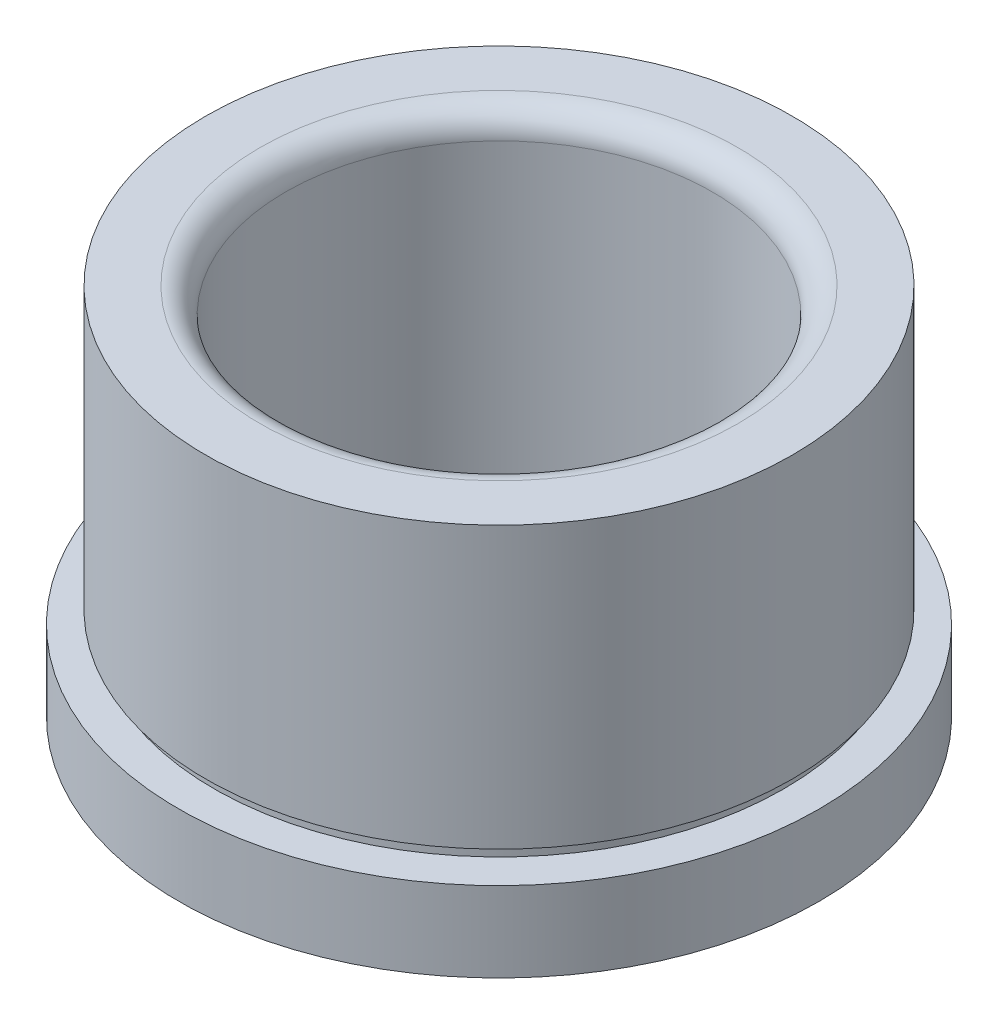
from build123d import *

# Parameters (mm, degrees)
FILLET1_R = 1.524


with BuildPart() as part:
    # Sketch1 → Revolve1 (revolve)
    with BuildSketch(Plane.XY, mode=Mode.PRIVATE) as revolve1_sk:
        Polygon((-12.70635, 38.150690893), (-12.70635, 16.741746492), (-13.522405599, 15.925690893), (-19.05, 15.925690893), (-19.05, 20.688190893), (-16.96085, 20.688190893), (-16.96085, 21.450190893), (-17.46885, 21.450190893), (-17.46885, 38.150690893), align=None)
    revolve(revolve1_sk.sketch.rotate(Axis((0, -1000, 0), (0, 1, 0)), 180), axis=Axis((0, -1000, 0), (0, 1, 0)))

    # Fillet1
    fillet1_edges = [part.edges().sort_by_distance(p)[0] for p in [
        (-12.70635, 38.150690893, 0),
    ]]
    fillet(fillet1_edges, radius=FILLET1_R)


solid = part.part
